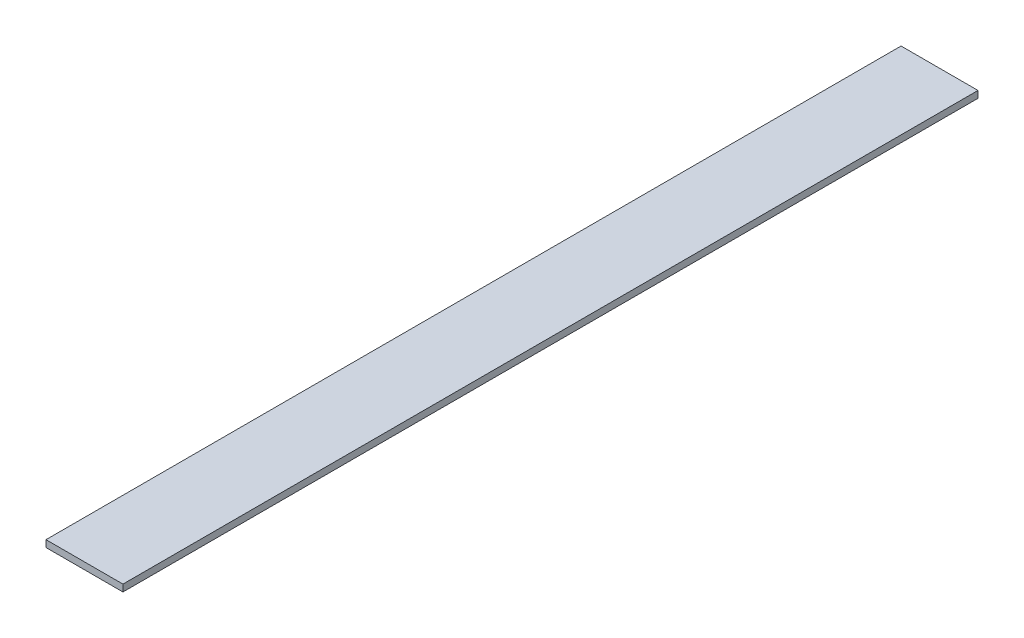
ISO-10303-21;
HEADER;
FILE_DESCRIPTION(('STEP AP214'),'2;1');
FILE_NAME('part.step','',(''),(''),'','','');
FILE_SCHEMA(('AUTOMOTIVE_DESIGN { 1 0 10303 214 1 1 1 1 }'));
ENDSEC;
DATA;
#1=APPLICATION_CONTEXT('core data for automotive mechanical design processes');
#2=APPLICATION_PROTOCOL_DEFINITION('international standard','automotive_design',2000,#1);
#3=PRODUCT_CONTEXT('',#1,'mechanical');
#4=PRODUCT('Part','Part','',(#3));
#5=PRODUCT_RELATED_PRODUCT_CATEGORY('part','',(#4));
#6=PRODUCT_DEFINITION_FORMATION('','',#4);
#7=PRODUCT_DEFINITION_CONTEXT('part definition',#1,'design');
#8=PRODUCT_DEFINITION('design','',#6,#7);
#9=PRODUCT_DEFINITION_SHAPE('','',#8);
#10=(LENGTH_UNIT() NAMED_UNIT(*) SI_UNIT(.MILLI.,.METRE.));
#11=(NAMED_UNIT(*) PLANE_ANGLE_UNIT() SI_UNIT($,.RADIAN.));
#12=(NAMED_UNIT(*) SI_UNIT($,.STERADIAN.) SOLID_ANGLE_UNIT());
#13=UNCERTAINTY_MEASURE_WITH_UNIT(LENGTH_MEASURE(1.E-05),#10,'distance_accuracy_value','');
#14=(GEOMETRIC_REPRESENTATION_CONTEXT(3) GLOBAL_UNCERTAINTY_ASSIGNED_CONTEXT((#13)) GLOBAL_UNIT_ASSIGNED_CONTEXT((#10,
#11,#12)) REPRESENTATION_CONTEXT('',''));
#15=CARTESIAN_POINT('',(0.,0.,0.));
#16=DIRECTION('',(0.,0.,1.));
#17=DIRECTION('',(1.,0.,0.));
#18=AXIS2_PLACEMENT_3D('',#15,#16,#17);
#19=CARTESIAN_POINT('',(22.5,0.,0.));
#20=DIRECTION('',(-1.,0.,0.));
#21=DIRECTION('',(0.,0.,1.));
#22=AXIS2_PLACEMENT_3D('',#19,#20,#21);
#23=PLANE('',#22);
#24=DIRECTION('',(0.,-1.,0.));
#25=VECTOR('',#24,1.);
#26=CARTESIAN_POINT('',(22.5,2.,0.));
#27=LINE('',#26,#25);
#28=CARTESIAN_POINT('',(22.5,4.,0.));
#29=VERTEX_POINT('',#28);
#30=CARTESIAN_POINT('',(22.5,0.,0.));
#31=VERTEX_POINT('',#30);
#32=EDGE_CURVE('E51',#29,#31,#27,.T.);
#33=ORIENTED_EDGE('',*,*,#32,.F.);
#34=DIRECTION('',(0.,0.,-1.));
#35=VECTOR('',#34,1.);
#36=CARTESIAN_POINT('',(22.5,4.,250.));
#37=LINE('',#36,#35);
#38=CARTESIAN_POINT('',(22.5,4.,500.));
#39=VERTEX_POINT('',#38);
#40=EDGE_CURVE('E66',#39,#29,#37,.T.);
#41=ORIENTED_EDGE('',*,*,#40,.F.);
#42=DIRECTION('',(0.,-1.,0.));
#43=VECTOR('',#42,1.);
#44=CARTESIAN_POINT('',(22.5,2.,500.));
#45=LINE('',#44,#43);
#46=CARTESIAN_POINT('',(22.5,0.,500.));
#47=VERTEX_POINT('',#46);
#48=EDGE_CURVE('E18',#39,#47,#45,.T.);
#49=ORIENTED_EDGE('',*,*,#48,.T.);
#50=DIRECTION('',(0.,0.,1.));
#51=VECTOR('',#50,1.);
#52=CARTESIAN_POINT('',(22.5,0.,250.));
#53=LINE('',#52,#51);
#54=EDGE_CURVE('E56',#31,#47,#53,.T.);
#55=ORIENTED_EDGE('',*,*,#54,.F.);
#56=EDGE_LOOP('',(#33,#41,#49,#55));
#57=FACE_BOUND('',#56,.T.);
#58=ADVANCED_FACE('F14',(#57),#23,.F.);
#59=CARTESIAN_POINT('',(22.5,0.,500.));
#60=DIRECTION('',(0.,0.,-1.));
#61=DIRECTION('',(-1.,0.,0.));
#62=AXIS2_PLACEMENT_3D('',#59,#60,#61);
#63=PLANE('',#62);
#64=DIRECTION('',(-1.,0.,0.));
#65=VECTOR('',#64,1.);
#66=CARTESIAN_POINT('',(0.,0.,500.));
#67=LINE('',#66,#65);
#68=CARTESIAN_POINT('',(-22.5,0.,500.));
#69=VERTEX_POINT('',#68);
#70=EDGE_CURVE('E61',#47,#69,#67,.T.);
#71=ORIENTED_EDGE('',*,*,#70,.F.);
#72=ORIENTED_EDGE('',*,*,#48,.F.);
#73=DIRECTION('',(1.,0.,0.));
#74=VECTOR('',#73,1.);
#75=CARTESIAN_POINT('',(0.,4.,500.));
#76=LINE('',#75,#74);
#77=CARTESIAN_POINT('',(-22.5,4.,500.));
#78=VERTEX_POINT('',#77);
#79=EDGE_CURVE('E79',#78,#39,#76,.T.);
#80=ORIENTED_EDGE('',*,*,#79,.F.);
#81=DIRECTION('',(0.,-1.,0.));
#82=VECTOR('',#81,1.);
#83=CARTESIAN_POINT('',(-22.5,2.,500.));
#84=LINE('',#83,#82);
#85=EDGE_CURVE('E72',#78,#69,#84,.T.);
#86=ORIENTED_EDGE('',*,*,#85,.T.);
#87=EDGE_LOOP('',(#71,#72,#80,#86));
#88=FACE_BOUND('',#87,.T.);
#89=ADVANCED_FACE('F71',(#88),#63,.F.);
#90=CARTESIAN_POINT('',(-22.5,0.,500.));
#91=DIRECTION('',(0.,-1.,0.));
#92=DIRECTION('',(0.,0.,-1.));
#93=AXIS2_PLACEMENT_3D('',#90,#91,#92);
#94=PLANE('',#93);
#95=ORIENTED_EDGE('',*,*,#70,.T.);
#96=DIRECTION('',(0.,0.,-1.));
#97=VECTOR('',#96,1.);
#98=CARTESIAN_POINT('',(-22.5,0.,250.));
#99=LINE('',#98,#97);
#100=CARTESIAN_POINT('',(-22.5,0.,0.));
#101=VERTEX_POINT('',#100);
#102=EDGE_CURVE('E82',#69,#101,#99,.T.);
#103=ORIENTED_EDGE('',*,*,#102,.T.);
#104=DIRECTION('',(-1.,0.,0.));
#105=VECTOR('',#104,1.);
#106=CARTESIAN_POINT('',(0.,0.,0.));
#107=LINE('',#106,#105);
#108=EDGE_CURVE('E63',#31,#101,#107,.T.);
#109=ORIENTED_EDGE('',*,*,#108,.F.);
#110=ORIENTED_EDGE('',*,*,#54,.T.);
#111=EDGE_LOOP('',(#95,#103,#109,#110));
#112=FACE_BOUND('',#111,.T.);
#113=ADVANCED_FACE('F58',(#112),#94,.T.);
#114=CARTESIAN_POINT('',(22.5,0.,0.));
#115=DIRECTION('',(0.,0.,-1.));
#116=DIRECTION('',(-1.,0.,0.));
#117=AXIS2_PLACEMENT_3D('',#114,#115,#116);
#118=PLANE('',#117);
#119=ORIENTED_EDGE('',*,*,#32,.T.);
#120=ORIENTED_EDGE('',*,*,#108,.T.);
#121=DIRECTION('',(0.,1.,0.));
#122=VECTOR('',#121,1.);
#123=CARTESIAN_POINT('',(-22.5,2.,0.));
#124=LINE('',#123,#122);
#125=CARTESIAN_POINT('',(-22.5,4.,0.));
#126=VERTEX_POINT('',#125);
#127=EDGE_CURVE('E24',#101,#126,#124,.T.);
#128=ORIENTED_EDGE('',*,*,#127,.T.);
#129=DIRECTION('',(-1.,0.,0.));
#130=VECTOR('',#129,1.);
#131=CARTESIAN_POINT('',(0.,4.,0.));
#132=LINE('',#131,#130);
#133=EDGE_CURVE('E32',#29,#126,#132,.T.);
#134=ORIENTED_EDGE('',*,*,#133,.F.);
#135=EDGE_LOOP('',(#119,#120,#128,#134));
#136=FACE_BOUND('',#135,.T.);
#137=ADVANCED_FACE('F86',(#136),#118,.T.);
#138=CARTESIAN_POINT('',(22.5,4.,0.));
#139=DIRECTION('',(0.,1.,0.));
#140=DIRECTION('',(-1.,0.,0.));
#141=AXIS2_PLACEMENT_3D('',#138,#139,#140);
#142=PLANE('',#141);
#143=DIRECTION('',(0.,0.,1.));
#144=VECTOR('',#143,1.);
#145=CARTESIAN_POINT('',(-22.5,4.,250.));
#146=LINE('',#145,#144);
#147=EDGE_CURVE('E9',#126,#78,#146,.T.);
#148=ORIENTED_EDGE('',*,*,#147,.T.);
#149=ORIENTED_EDGE('',*,*,#79,.T.);
#150=ORIENTED_EDGE('',*,*,#40,.T.);
#151=ORIENTED_EDGE('',*,*,#133,.T.);
#152=EDGE_LOOP('',(#148,#149,#150,#151));
#153=FACE_BOUND('',#152,.T.);
#154=ADVANCED_FACE('F88',(#153),#142,.T.);
#155=CARTESIAN_POINT('',(-22.5,0.,500.));
#156=DIRECTION('',(1.,0.,0.));
#157=DIRECTION('',(0.,0.,-1.));
#158=AXIS2_PLACEMENT_3D('',#155,#156,#157);
#159=PLANE('',#158);
#160=ORIENTED_EDGE('',*,*,#127,.F.);
#161=ORIENTED_EDGE('',*,*,#102,.F.);
#162=ORIENTED_EDGE('',*,*,#85,.F.);
#163=ORIENTED_EDGE('',*,*,#147,.F.);
#164=EDGE_LOOP('',(#160,#161,#162,#163));
#165=FACE_BOUND('',#164,.T.);
#166=ADVANCED_FACE('F16',(#165),#159,.F.);
#167=CLOSED_SHELL('',(#58,#89,#113,#137,#154,#166));
#168=MANIFOLD_SOLID_BREP('B1',#167);
#169=ADVANCED_BREP_SHAPE_REPRESENTATION('',(#18,#168),#14);
#170=SHAPE_DEFINITION_REPRESENTATION(#9,#169);
ENDSEC;
END-ISO-10303-21;
